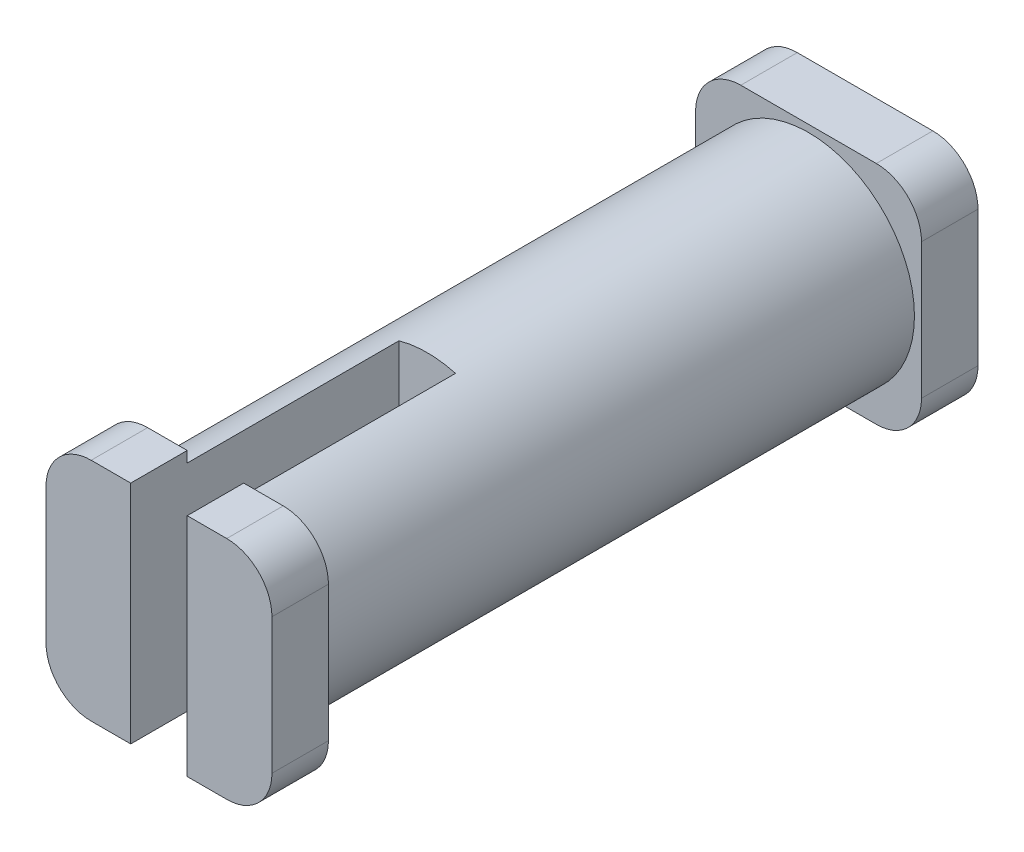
from build123d import *

# Parameters (mm, degrees)
BOSS_EXTRUDE1_DEPTH = 1.5875
SKETCH2_R           = 2.9765625
BOSS_EXTRUDE2_DEPTH = 16.66875
SKETCH3_W           = 1.5875
SKETCH3_H           = 6.35
CUT_EXTRUDE1_DEPTH  = 7.540625


with BuildPart() as part:
    # Sketch1 → Boss-Extrude1 (new body)
    with BuildSketch(Plane.XY):
        with BuildLine():
            Line((1.27, 0), (5.08, 0))
            ThreePointArc((5.08, 0), (5.978025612, 0.371974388), (6.35, 1.27))
            Line((6.35, 1.27), (6.35, 5.08))
            ThreePointArc((6.35, 5.08), (5.978025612, 5.978025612), (5.08, 6.35))
            Line((5.08, 6.35), (1.27, 6.35))
            ThreePointArc((1.27, 6.35), (0.371974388, 5.978025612), (0, 5.08))
            Line((0, 5.08), (0, 1.27))
            ThreePointArc((0, 1.27), (0.371974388, 0.371974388), (1.27, 0))
        make_face()
    boss_extrude1 = extrude(amount=BOSS_EXTRUDE1_DEPTH)

    # Sketch2 → Boss-Extrude2 (add)
    with BuildSketch(Plane.XY.offset(1.5875)):
        with Locations((3.175, 3.175)):
            Circle(SKETCH2_R)
    extrude(amount=BOSS_EXTRUDE2_DEPTH)

    # Mirror1: Boss-Extrude1 across plane
    add(boss_extrude1.mirror(Plane.XY.offset(9.921875)))

    # Sketch3 → Cut-Extrude1 (cut)
    with BuildSketch(Plane.XY.offset(19.84375)):
        with Locations((3.175, 3.175)):
            Rectangle(SKETCH3_W, SKETCH3_H)
    extrude(amount=-CUT_EXTRUDE1_DEPTH, mode=Mode.SUBTRACT)


solid = part.part
